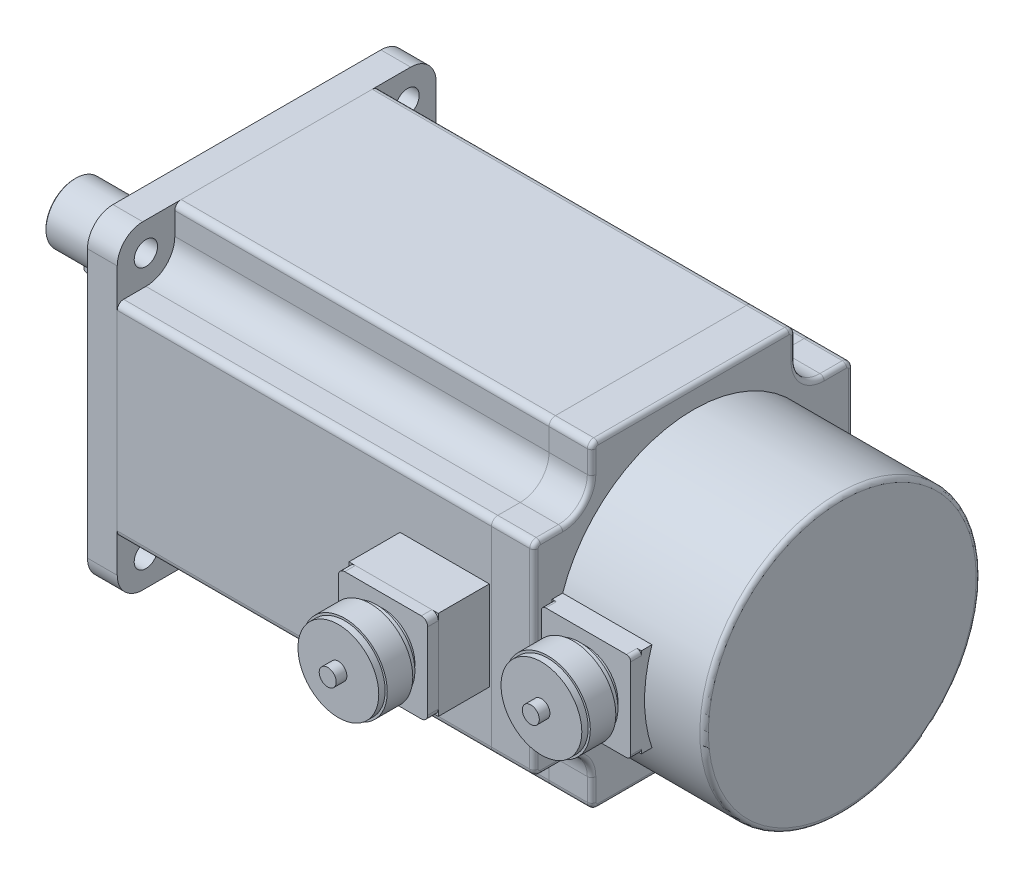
from build123d import *

# Parameters (mm, degrees)
EXTRUDE_1_DEPTH     = 20
EXTRUDE_2_DEPTH     = 176
EXTRUDE_3_DEPTH     = 14
SKETCH_4_W          = 42
SKETCH_4_H          = 42
EXTRUDE_4_DEPTH     = 24
EXTRUDE_5_DEPTH     = 5
SKETCH_6_R          = 15
EXTRUDE_6_DEPTH     = 3
SKETCH_7_R          = 18
EXTRUDE_7_DEPTH     = 3
SKETCH_8_R          = 20
EXTRUDE_8_DEPTH     = 12
SKETCH_9_R          = 19
EXTRUDE_9_DEPTH     = 3
SKETCH_10_R         = 4
EXTRUDE_10_DEPTH    = 5
CUT_EXTRUDE_START   = -196
CUT_EXTRUDE_2_DEPTH = 196
FILLET_1_R          = 2
SKETCH_12_R         = 5.5
CUT_EXTRUDE_3_DEPTH = 14
SKETCH_13_R         = 65
SKETCH_13_R_2       = 57.5
EXTRUDE_11_DEPTH    = 6
SKETCH_14_R         = 35
EXTRUDE_12_DEPTH    = 6
SKETCH_15_R         = 17.5
EXTRUDE_13_DEPTH    = 3
FILLET_2_R          = 0.5
SKETCH_16_R         = 14
EXTRUDE_14_DEPTH    = 72
CHAMFER_1_SIZE      = 0.5
SKETCH_19_R         = 65
EXTRUDE_16_DEPTH    = 70
FILLET_3_R          = 2
SKETCH_20_W         = 42
SKETCH_20_H         = 42
CUT_EXTRUDE_5_DEPTH = 10
SKETCH_21_W         = 42
SKETCH_21_H         = 42
EXTRUDE_17_DEPTH    = 11.5
EXTRUDE_18_DEPTH    = 5
SKETCH_23_R         = 15
EXTRUDE_19_DEPTH    = 3
SKETCH_24_R         = 18
EXTRUDE_20_DEPTH    = 3
SKETCH_25_R         = 20
EXTRUDE_21_DEPTH    = 12
SKETCH_26_R         = 19
EXTRUDE_22_DEPTH    = 3
SKETCH_27_R         = 4
EXTRUDE_23_DEPTH    = 5
CUT_EXTRUDE_6_DEPTH = 4
EXTRUDE_24_DEPTH    = 8


with BuildPart() as part:
    # Sketch 1 → Extrude 1 (new body)
    with BuildSketch(Plane(origin=(0, 0, 0), x_dir=(0, 0, -1), z_dir=(1, 0, 0))):
        with BuildLine():
            Line((-63, -75), (63, -75))
            ThreePointArc((63, -75), (71.485281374, -71.485281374), (75, -63))
            Line((75, -63), (75, 63))
            ThreePointArc((75, 63), (71.485281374, 71.485281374), (63, 75))
            Line((63, 75), (-63, 75))
            ThreePointArc((-63, 75), (-71.485281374, 71.485281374), (-75, 63))
            Line((-75, 63), (-75, -63))
            ThreePointArc((-75, -63), (-71.485281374, -71.485281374), (-63, -75))
        make_face()
    extrude(amount=EXTRUDE_1_DEPTH)


with BuildPart() as body_2:
    # Sketch 2 → Extrude 2 (new body)
    with BuildSketch(Plane.ZY):
        with BuildLine():
            Line((-63, -75), (63, -75))
            ThreePointArc((63, -75), (71.485281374, -71.485281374), (75, -63))
            Line((75, -63), (75, 63))
            ThreePointArc((75, 63), (71.485281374, 71.485281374), (63, 75))
            Line((63, 75), (-63, 75))
            ThreePointArc((-63, 75), (-71.485281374, 71.485281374), (-75, 63))
            Line((-75, 63), (-75, -63))
            ThreePointArc((-75, -63), (-71.485281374, -71.485281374), (-63, -75))
        make_face()
    extrude(amount=EXTRUDE_2_DEPTH)


with BuildPart() as body_3:
    # Sketch 3 → Extrude 3 (new body)
    with BuildSketch(Plane.ZY.offset(176)):
        with BuildLine():
            Line((-63, -75), (63, -75))
            ThreePointArc((63, -75), (71.485281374, -71.485281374), (75, -63))
            Line((75, -63), (75, 63))
            ThreePointArc((75, 63), (71.485281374, 71.485281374), (63, 75))
            Line((63, 75), (-63, 75))
            ThreePointArc((-63, 75), (-71.485281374, 71.485281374), (-75, 63))
            Line((-75, 63), (-75, -63))
            ThreePointArc((-75, -63), (-71.485281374, -71.485281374), (-63, -75))
        make_face()
    extrude(amount=EXTRUDE_3_DEPTH)

    # Sketch 12 → Cut-Extrude 3 (cut)
    with BuildSketch(Plane.ZY.offset(190)):
        with Locations((-61.518289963, 61.518289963)):
            Circle(SKETCH_12_R)
        with Locations((61.518289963, 61.518289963)):
            Circle(SKETCH_12_R)
        with Locations((-61.518289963, -61.518289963)):
            Circle(SKETCH_12_R)
        with Locations((61.518289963, -61.518289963)):
            Circle(SKETCH_12_R)
    extrude(amount=-CUT_EXTRUDE_3_DEPTH, mode=Mode.SUBTRACT)



with BuildPart() as body_4:
    # Sketch 4 → Extrude 4 (new body)
    with BuildSketch(Plane.XY.offset(75)):
        with Locations((-22, 0)):
            Rectangle(SKETCH_4_W, SKETCH_4_H)
    extrude(amount=EXTRUDE_4_DEPTH)


with BuildPart() as body_5:
    # Sketch 5 → Extrude 5 (new body)
    with BuildSketch(Plane.XY.offset(99)):
        with BuildLine():
            Line((-40, -21), (-4, -21))
            ThreePointArc((-4, -21), (-1.878679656, -20.121320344), (-1, -18))
            Line((-1, -18), (-1, 18))
            ThreePointArc((-1, 18), (-1.878679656, 20.121320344), (-4, 21))
            Line((-4, 21), (-40, 21))
            ThreePointArc((-40, 21), (-42.121320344, 20.121320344), (-43, 18))
            Line((-43, 18), (-43, -18))
            ThreePointArc((-43, -18), (-42.121320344, -20.121320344), (-40, -21))
        make_face()
    extrude(amount=EXTRUDE_5_DEPTH)


with BuildPart() as body_6:
    # Sketch 6 → Extrude 6 (new body)
    with BuildSketch(Plane.XY.offset(104)):
        with Locations((-22, 0)):
            Circle(SKETCH_6_R)
    extrude(amount=EXTRUDE_6_DEPTH)


with BuildPart() as body_7:
    # Sketch 7 → Extrude 7 (new body)
    with BuildSketch(Plane.XY.offset(107)):
        with Locations((-22, 0)):
            Circle(SKETCH_7_R)
    extrude(amount=EXTRUDE_7_DEPTH)


with BuildPart() as body_8:
    # Sketch 8 → Extrude 8 (new body)
    with BuildSketch(Plane.XY.offset(110)):
        with Locations((-22, 0)):
            Circle(SKETCH_8_R)
    extrude(amount=EXTRUDE_8_DEPTH)

    # Sketch 9 → Extrude 9 (add)
    with BuildSketch(Plane.XY.offset(122)):
        with Locations((-22, 0)):
            Circle(SKETCH_9_R)
    extrude(amount=EXTRUDE_9_DEPTH)

    # Sketch 10 → Extrude 10 (add)
    with BuildSketch(Plane.XY.offset(125)):
        with Locations((-22, 0)):
            Circle(SKETCH_10_R)
    extrude(amount=EXTRUDE_10_DEPTH)


with BuildPart() as cut_extrude_2_tool:
    # Sketch 11 → Cut-Extrude 2 (new body)
    with BuildSketch(Plane(origin=(20, 0, 0), x_dir=(0, 0, -1), z_dir=(1, 0, 0)).offset(CUT_EXTRUDE_START)):
        with BuildLine():
            Line((47.916922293, -61.5), (47.916922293, -72))
            ThreePointArc((47.916922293, -72), (47.038242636, -74.121320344), (44.916922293, -75))
            Line((44.916922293, -75), (63, -75))
            ThreePointArc((63, -75), (71.485281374, -71.485281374), (75, -63))
            Line((75, -63), (75, -44.916922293))
            ThreePointArc((75, -44.916922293), (74.121320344, -47.038242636), (72, -47.916922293))
            Line((72, -47.916922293), (61.5, -47.916922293))
            ThreePointArc((61.5, -47.916922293), (51.895313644, -51.895313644), (47.916922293, -61.5))
        make_face()
        with BuildLine():
            Line((-75, -44.916922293), (-75, -63))
            ThreePointArc((-75, -63), (-71.485281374, -71.485281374), (-63, -75))
            Line((-63, -75), (-44.916922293, -75))
            ThreePointArc((-44.916922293, -75), (-47.038242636, -74.121320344), (-47.916922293, -72))
            Line((-47.916922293, -72), (-47.916922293, -61.5))
            ThreePointArc((-47.916922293, -61.5), (-51.895313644, -51.895313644), (-61.5, -47.916922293))
            Line((-61.5, -47.916922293), (-72, -47.916922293))
            ThreePointArc((-72, -47.916922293), (-74.121320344, -47.038242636), (-75, -44.916922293))
        make_face()
        with BuildLine():
            Line((75, 63), (75, 44.916922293))
            ThreePointArc((75, 44.916922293), (74.121320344, 47.038242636), (72, 47.916922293))
            Line((72, 47.916922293), (61.5, 47.916922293))
            ThreePointArc((61.5, 47.916922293), (51.895313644, 51.895313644), (47.916922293, 61.5))
            Line((47.916922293, 61.5), (47.916922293, 72))
            ThreePointArc((47.916922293, 72), (47.038242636, 74.121320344), (44.916922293, 75))
            Line((44.916922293, 75), (63, 75))
            ThreePointArc((63, 75), (71.485281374, 71.485281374), (75, 63))
        make_face()
        with BuildLine():
            Line((-44.916922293, 75), (-63, 75))
            ThreePointArc((-63, 75), (-71.485281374, 71.485281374), (-75, 63))
            Line((-75, 63), (-75, 44.916922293))
            ThreePointArc((-75, 44.916922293), (-74.121320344, 47.038242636), (-72, 47.916922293))
            Line((-72, 47.916922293), (-61.5, 47.916922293))
            ThreePointArc((-61.5, 47.916922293), (-51.895313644, 51.895313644), (-47.916922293, 61.5))
            Line((-47.916922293, 61.5), (-47.916922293, 72))
            ThreePointArc((-47.916922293, 72), (-47.038242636, 74.121320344), (-44.916922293, 75))
        make_face()
    extrude(amount=CUT_EXTRUDE_2_DEPTH)


with BuildPart() as part_1:
    add(part.part)

    # Cut-Extrude 2: cut by cut_extrude_2_tool
    add(cut_extrude_2_tool.part, mode=Mode.SUBTRACT)

    # Fillet 1
    fillet_1_edges = [part_1.edges().sort_by_distance(p)[0] for p in [
        (20, 51.895313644, -51.895313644),
        (20, 47.916922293, -66.75),
        (20, 47.038242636, -74.121320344),
        (20, 74.121320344, -47.038242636),
        (20, 66.75, -47.916922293),
        (20, 0, -75),
        (20, 75, 0),
        (20, 0, 75),
        (20, -75, 0),
        (20, -47.038242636, 74.121320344),
        (20, -74.121320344, 47.038242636),
        (20, -66.75, 47.916922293),
        (20, -51.895313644, 51.895313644),
        (20, -47.916922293, 66.75),
        (20, -51.895313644, -51.895313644),
        (20, -66.75, -47.916922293),
        (20, -74.121320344, -47.038242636),
        (20, -47.038242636, -74.121320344),
        (20, -47.916922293, -66.75),
        (20, 47.038242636, 74.121320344),
        (20, 47.916922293, 66.75),
        (20, 51.895313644, 51.895313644),
        (20, 66.75, 47.916922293),
        (20, 74.121320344, 47.038242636),
    ]]
    fillet(fillet_1_edges, radius=FILLET_1_R)



with BuildPart() as body_2_1:
    add(body_2.part)

    # Cut-Extrude 2: cut by cut_extrude_2_tool
    add(cut_extrude_2_tool.part, mode=Mode.SUBTRACT)


with BuildPart() as body_9:
    # Sketch 13 → Extrude 11 (new body)
    with BuildSketch(Plane.ZY.offset(190)):
        Circle(SKETCH_13_R)
        Circle(SKETCH_13_R_2, mode=Mode.SUBTRACT)
    extrude(amount=EXTRUDE_11_DEPTH)


with BuildPart() as body_3_1:
    add(body_3.part)

    add(body_9.part)  # Extrude 12 merges body 9
    # Sketch 14 → Extrude 12 (add)
    with BuildSketch(Plane.ZY.offset(190)):
        with Locations(Location((0, 0, 0), (0, 0, 180))):
            Circle(SKETCH_14_R)
    extrude(amount=EXTRUDE_12_DEPTH)


with BuildPart() as body_9_2:
    # Sketch 15 → Extrude 13 (new body)
    with BuildSketch(Plane.ZY.offset(196)):
        Circle(SKETCH_15_R)
    extrude(amount=EXTRUDE_13_DEPTH)

    # Fillet 2
    fillet_2_edges = [body_9_2.edges().sort_by_distance(p)[0] for p in [
        (-199, 0, -17.5),
    ]]
    fillet(fillet_2_edges, radius=FILLET_2_R)

    # Sketch 16 → Extrude 14 (add)
    with BuildSketch(Plane.ZY.offset(199)):
        Circle(SKETCH_16_R)
    extrude(amount=EXTRUDE_14_DEPTH)

    # Chamfer 1
    chamfer_1_edges = [body_9_2.edges().sort_by_distance(p)[0] for p in [
        (-271, 0, -14),
    ]]
    chamfer(chamfer_1_edges, length=CHAMFER_1_SIZE)

    # Sketch 29 → Cut-Extrude 6 (cut)
    with BuildSketch(Plane(origin=(0, -14, 0), x_dir=(1, 0, 0), z_dir=(0, 1, 0))):
        with BuildLine():
            Line((-261, -4), (-214, -4))
            ThreePointArc((-214, -4), (-210, 0), (-214, 4))
            Line((-214, 4), (-261, 4))
            ThreePointArc((-261, 4), (-265, 0), (-261, -4))
        make_face()
    extrude(amount=CUT_EXTRUDE_6_DEPTH, mode=Mode.SUBTRACT)


with BuildPart() as body_10:
    # Sketch 19 → Extrude 16 (new body)
    with BuildSketch(Plane(origin=(20, 0, 0), x_dir=(0, 0, -1), z_dir=(1, 0, 0))):
        Circle(SKETCH_19_R)
    extrude(amount=EXTRUDE_16_DEPTH)

    # Fillet 3
    fillet_3_edges = [body_10.edges().sort_by_distance(p)[0] for p in [
        (90, 0, 65),
    ]]
    fillet(fillet_3_edges, radius=FILLET_3_R)

    # Sketch 20 → Cut-Extrude 5 (cut)
    with BuildSketch(Plane.XY.offset(65)):
        with Locations((41, 0)):
            Rectangle(SKETCH_20_W, SKETCH_20_H)
    extrude(amount=-CUT_EXTRUDE_5_DEPTH, mode=Mode.SUBTRACT)


with BuildPart() as part_2:
    add(part_1.part)

    add(body_10.part)  # Extrude 17 merges body 10
    # Sketch 21 → Extrude 17 (add)
    with BuildSketch(Plane.XY.offset(55)):
        with Locations((41, 0)):
            Rectangle(SKETCH_21_W, SKETCH_21_H)
    extrude(amount=EXTRUDE_17_DEPTH)



with BuildPart() as body_10_2:
    # Sketch 22 → Extrude 18 (new body)
    with BuildSketch(Plane.XY.offset(66.5)):
        with BuildLine():
            Line((22, -21), (60, -21))
            ThreePointArc((60, -21), (61.414213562, -20.414213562), (62, -19))
            Line((62, -19), (62, 19))
            ThreePointArc((62, 19), (61.414213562, 20.414213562), (60, 21))
            Line((60, 21), (22, 21))
            ThreePointArc((22, 21), (20.585786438, 20.414213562), (20, 19))
            Line((20, 19), (20, -19))
            ThreePointArc((20, -19), (20.585786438, -20.414213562), (22, -21))
        make_face()
    extrude(amount=EXTRUDE_18_DEPTH)


with BuildPart() as part_3:
    add(part_2.part)

    add(body_10_2.part)  # Extrude 19 merges body 10 2
    # Sketch 23 → Extrude 19 (add)
    with BuildSketch(Plane.XY.offset(71.5)):
        with Locations(Location((41, 0, 0), (0, 0, 180))):
            Circle(SKETCH_23_R)
    extrude(amount=EXTRUDE_19_DEPTH)

    # Sketch 24 → Extrude 20 (add)
    with BuildSketch(Plane.XY.offset(74.5)):
        with Locations((41, 0)):
            Circle(SKETCH_24_R)
    extrude(amount=EXTRUDE_20_DEPTH)

    # Sketch 25 → Extrude 21 (add)
    with BuildSketch(Plane.XY.offset(77.5)):
        with Locations((41, 0)):
            Circle(SKETCH_25_R)
    extrude(amount=EXTRUDE_21_DEPTH)

    # Sketch 26 → Extrude 22 (add)
    with BuildSketch(Plane.XY.offset(89.5)):
        with Locations((41, 0)):
            Circle(SKETCH_26_R)
    extrude(amount=EXTRUDE_22_DEPTH)

    # Sketch 27 → Extrude 23 (add)
    with BuildSketch(Plane.XY.offset(92.5)):
        with Locations((41, 0)):
            Circle(SKETCH_27_R)
    extrude(amount=EXTRUDE_23_DEPTH)


with BuildPart() as body_10_3:
    # Sketch 30 → Extrude 24 (new body)
    with BuildSketch(Plane.XZ.offset(10)):
        with BuildLine():
            Line((-261, 4), (-214, 4))
            ThreePointArc((-214, 4), (-210, 0), (-214, -4))
            Line((-214, -4), (-261, -4))
            ThreePointArc((-261, -4), (-265, 0), (-261, 4))
        make_face()
    extrude(amount=EXTRUDE_24_DEPTH)


solid = Compound([body_4.part, body_5.part, body_6.part, body_7.part, body_8.part, body_2_1.part, body_3_1.part, body_9_2.part, part_3.part, body_10_3.part])
